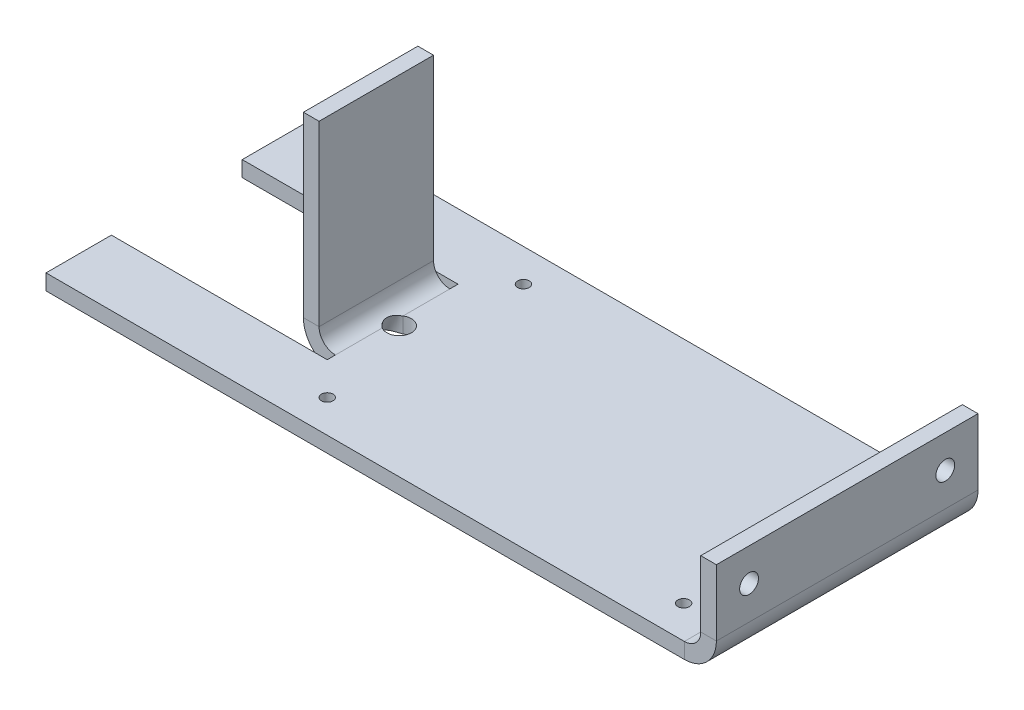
ISO-10303-21;
HEADER;
FILE_DESCRIPTION(('STEP AP214'),'2;1');
FILE_NAME('part.step','',(''),(''),'','','');
FILE_SCHEMA(('AUTOMOTIVE_DESIGN { 1 0 10303 214 1 1 1 1 }'));
ENDSEC;
DATA;
#1=APPLICATION_CONTEXT('core data for automotive mechanical design processes');
#2=APPLICATION_PROTOCOL_DEFINITION('international standard','automotive_design',2000,#1);
#3=PRODUCT_CONTEXT('',#1,'mechanical');
#4=PRODUCT('Part','Part','',(#3));
#5=PRODUCT_RELATED_PRODUCT_CATEGORY('part','',(#4));
#6=PRODUCT_DEFINITION_FORMATION('','',#4);
#7=PRODUCT_DEFINITION_CONTEXT('part definition',#1,'design');
#8=PRODUCT_DEFINITION('design','',#6,#7);
#9=PRODUCT_DEFINITION_SHAPE('','',#8);
#10=(LENGTH_UNIT() NAMED_UNIT(*) SI_UNIT(.MILLI.,.METRE.));
#11=(NAMED_UNIT(*) PLANE_ANGLE_UNIT() SI_UNIT($,.RADIAN.));
#12=(NAMED_UNIT(*) SI_UNIT($,.STERADIAN.) SOLID_ANGLE_UNIT());
#13=UNCERTAINTY_MEASURE_WITH_UNIT(LENGTH_MEASURE(1.E-05),#10,'distance_accuracy_value','');
#14=(GEOMETRIC_REPRESENTATION_CONTEXT(3) GLOBAL_UNCERTAINTY_ASSIGNED_CONTEXT((#13)) GLOBAL_UNIT_ASSIGNED_CONTEXT((#10,
#11,#12)) REPRESENTATION_CONTEXT('',''));
#15=CARTESIAN_POINT('',(0.,0.,0.));
#16=DIRECTION('',(0.,0.,1.));
#17=DIRECTION('',(1.,0.,0.));
#18=AXIS2_PLACEMENT_3D('',#15,#16,#17);
#19=CARTESIAN_POINT('',(-130.175,3.03784,25.4));
#20=DIRECTION('',(0.,1.,0.));
#21=DIRECTION('',(0.,0.,1.));
#22=AXIS2_PLACEMENT_3D('',#19,#20,#21);
#23=PLANE('',#22);
#24=CARTESIAN_POINT('',(-81.915,3.03784,-19.05));
#25=DIRECTION('',(0.,1.,0.));
#26=DIRECTION('',(0.,0.,1.));
#27=AXIS2_PLACEMENT_3D('',#24,#25,#26);
#28=CIRCLE('',#27,1.1303);
#29=CARTESIAN_POINT('',(-81.915,3.03784,-17.9197));
#30=VERTEX_POINT('',#29);
#31=EDGE_CURVE('E849',#30,#30,#28,.T.);
#32=ORIENTED_EDGE('',*,*,#31,.F.);
#33=EDGE_LOOP('',(#32));
#34=FACE_BOUND('',#33,.T.);
#35=CARTESIAN_POINT('',(-12.7,3.03784,-19.05));
#36=DIRECTION('',(0.,1.,0.));
#37=DIRECTION('',(0.,0.,1.));
#38=AXIS2_PLACEMENT_3D('',#35,#36,#37);
#39=CIRCLE('',#38,1.1303);
#40=CARTESIAN_POINT('',(-12.7,3.03784,-17.9197));
#41=VERTEX_POINT('',#40);
#42=EDGE_CURVE('E855',#41,#41,#39,.T.);
#43=ORIENTED_EDGE('',*,*,#42,.F.);
#44=EDGE_LOOP('',(#43));
#45=FACE_BOUND('',#44,.T.);
#46=CARTESIAN_POINT('',(-12.7,3.03784,19.05));
#47=DIRECTION('',(0.,1.,0.));
#48=DIRECTION('',(0.,0.,1.));
#49=AXIS2_PLACEMENT_3D('',#46,#47,#48);
#50=CIRCLE('',#49,1.1303);
#51=CARTESIAN_POINT('',(-12.7,3.03784,20.1803));
#52=VERTEX_POINT('',#51);
#53=EDGE_CURVE('E863',#52,#52,#50,.T.);
#54=ORIENTED_EDGE('',*,*,#53,.F.);
#55=EDGE_LOOP('',(#54));
#56=FACE_BOUND('',#55,.T.);
#57=CARTESIAN_POINT('',(-81.915,3.03784,19.05));
#58=DIRECTION('',(0.,1.,0.));
#59=DIRECTION('',(0.,0.,1.));
#60=AXIS2_PLACEMENT_3D('',#57,#58,#59);
#61=CIRCLE('',#60,1.1303);
#62=CARTESIAN_POINT('',(-81.915,3.03784,20.1803));
#63=VERTEX_POINT('',#62);
#64=EDGE_CURVE('E869',#63,#63,#61,.T.);
#65=ORIENTED_EDGE('',*,*,#64,.F.);
#66=EDGE_LOOP('',(#65));
#67=FACE_BOUND('',#66,.T.);
#68=DIRECTION('',(0.,0.,1.));
#69=VECTOR('',#68,1.);
#70=CARTESIAN_POINT('',(-88.265,3.03784000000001,11.1125));
#71=LINE('',#70,#69);
#72=CARTESIAN_POINT('',(-88.265,3.03784000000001,-2.01431168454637));
#73=VERTEX_POINT('',#72);
#74=CARTESIAN_POINT('',(-88.265,3.03784000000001,-11.1125));
#75=VERTEX_POINT('',#74);
#76=EDGE_CURVE('E808',#73,#75,#71,.F.);
#77=ORIENTED_EDGE('',*,*,#76,.F.);
#78=CARTESIAN_POINT('',(-86.995,3.03784,0.));
#79=DIRECTION('',(0.,1.,0.));
#80=DIRECTION('',(0.,0.,1.));
#81=AXIS2_PLACEMENT_3D('',#78,#79,#80);
#82=CIRCLE('',#81,2.38125000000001);
#83=CARTESIAN_POINT('',(-88.265,3.03784000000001,2.01431168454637));
#84=VERTEX_POINT('',#83);
#85=EDGE_CURVE('E81',#84,#73,#82,.T.);
#86=ORIENTED_EDGE('',*,*,#85,.F.);
#87=CARTESIAN_POINT('',(-88.265,3.03784000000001,11.1125));
#88=VERTEX_POINT('',#87);
#89=EDGE_CURVE('E227',#88,#84,#71,.F.);
#90=ORIENTED_EDGE('',*,*,#89,.F.);
#91=DIRECTION('',(0.,0.,-1.));
#92=VECTOR('',#91,1.);
#93=CARTESIAN_POINT('',(-88.265,3.03784,-12.7));
#94=LINE('',#93,#92);
#95=CARTESIAN_POINT('',(-88.265,3.03784,12.7));
#96=VERTEX_POINT('',#95);
#97=EDGE_CURVE('E263',#96,#88,#94,.T.);
#98=ORIENTED_EDGE('',*,*,#97,.F.);
#99=DIRECTION('',(1.,0.,0.));
#100=VECTOR('',#99,1.);
#101=CARTESIAN_POINT('',(-130.175,3.03784,12.7));
#102=LINE('',#101,#100);
#103=CARTESIAN_POINT('',(-130.175,3.03784,12.7));
#104=VERTEX_POINT('',#103);
#105=EDGE_CURVE('E264',#104,#96,#102,.T.);
#106=ORIENTED_EDGE('',*,*,#105,.F.);
#107=DIRECTION('',(0.,0.,-1.));
#108=VECTOR('',#107,1.);
#109=CARTESIAN_POINT('',(-130.175,3.03784,25.4));
#110=LINE('',#109,#108);
#111=CARTESIAN_POINT('',(-130.175,3.03784,25.4));
#112=VERTEX_POINT('',#111);
#113=EDGE_CURVE('E337',#112,#104,#110,.T.);
#114=ORIENTED_EDGE('',*,*,#113,.F.);
#115=DIRECTION('',(1.,0.,0.));
#116=VECTOR('',#115,1.);
#117=CARTESIAN_POINT('',(-130.175,3.03784,25.4));
#118=LINE('',#117,#116);
#119=CARTESIAN_POINT('',(-6.21284,3.03784,25.4));
#120=VERTEX_POINT('',#119);
#121=EDGE_CURVE('E292',#112,#120,#118,.T.);
#122=ORIENTED_EDGE('',*,*,#121,.T.);
#123=DIRECTION('',(0.,0.,-1.));
#124=VECTOR('',#123,1.);
#125=CARTESIAN_POINT('',(-6.21284,3.03784,25.4));
#126=LINE('',#125,#124);
#127=CARTESIAN_POINT('',(-6.21284,3.03784,-25.4));
#128=VERTEX_POINT('',#127);
#129=EDGE_CURVE('E340',#120,#128,#126,.T.);
#130=ORIENTED_EDGE('',*,*,#129,.T.);
#131=DIRECTION('',(1.,0.,0.));
#132=VECTOR('',#131,1.);
#133=CARTESIAN_POINT('',(-130.175,3.03784,-25.4));
#134=LINE('',#133,#132);
#135=CARTESIAN_POINT('',(-130.175,3.03784,-25.4));
#136=VERTEX_POINT('',#135);
#137=EDGE_CURVE('E316',#136,#128,#134,.T.);
#138=ORIENTED_EDGE('',*,*,#137,.F.);
#139=CARTESIAN_POINT('',(-130.175,3.03784,-12.7));
#140=VERTEX_POINT('',#139);
#141=EDGE_CURVE('E336',#140,#136,#110,.T.);
#142=ORIENTED_EDGE('',*,*,#141,.F.);
#143=DIRECTION('',(-1.,0.,0.));
#144=VECTOR('',#143,1.);
#145=CARTESIAN_POINT('',(-130.175,3.03784,-12.7));
#146=LINE('',#145,#144);
#147=CARTESIAN_POINT('',(-88.265,3.03784,-12.7));
#148=VERTEX_POINT('',#147);
#149=EDGE_CURVE('E252',#148,#140,#146,.T.);
#150=ORIENTED_EDGE('',*,*,#149,.F.);
#151=EDGE_CURVE('E260',#75,#148,#94,.T.);
#152=ORIENTED_EDGE('',*,*,#151,.F.);
#153=EDGE_LOOP('',(#77,#86,#90,#98,#106,#114,#122,#130,#138,#142,#150,#152));
#154=FACE_BOUND('',#153,.T.);
#155=ADVANCED_FACE('F56',(#34,#45,#56,#67,#154),#23,.T.);
#156=CARTESIAN_POINT('',(-130.175,0.,25.4));
#157=DIRECTION('',(0.,1.,0.));
#158=DIRECTION('',(0.,0.,1.));
#159=AXIS2_PLACEMENT_3D('',#156,#157,#158);
#160=PLANE('',#159);
#161=CARTESIAN_POINT('',(-81.915,0.,-19.05));
#162=DIRECTION('',(0.,1.,0.));
#163=DIRECTION('',(0.,0.,1.));
#164=AXIS2_PLACEMENT_3D('',#161,#162,#163);
#165=CIRCLE('',#164,1.1303);
#166=CARTESIAN_POINT('',(-81.915,0.,-17.9197));
#167=VERTEX_POINT('',#166);
#168=EDGE_CURVE('E824',#167,#167,#165,.T.);
#169=ORIENTED_EDGE('',*,*,#168,.T.);
#170=EDGE_LOOP('',(#169));
#171=FACE_BOUND('',#170,.T.);
#172=CARTESIAN_POINT('',(-12.7,0.,-19.05));
#173=DIRECTION('',(0.,1.,0.));
#174=DIRECTION('',(0.,0.,1.));
#175=AXIS2_PLACEMENT_3D('',#172,#173,#174);
#176=CIRCLE('',#175,1.1303);
#177=CARTESIAN_POINT('',(-12.7,0.,-17.9197));
#178=VERTEX_POINT('',#177);
#179=EDGE_CURVE('E852',#178,#178,#176,.T.);
#180=ORIENTED_EDGE('',*,*,#179,.T.);
#181=EDGE_LOOP('',(#180));
#182=FACE_BOUND('',#181,.T.);
#183=CARTESIAN_POINT('',(-12.7,0.,19.05));
#184=DIRECTION('',(0.,1.,0.));
#185=DIRECTION('',(0.,0.,1.));
#186=AXIS2_PLACEMENT_3D('',#183,#184,#185);
#187=CIRCLE('',#186,1.1303);
#188=CARTESIAN_POINT('',(-12.7,0.,20.1803));
#189=VERTEX_POINT('',#188);
#190=EDGE_CURVE('E860',#189,#189,#187,.T.);
#191=ORIENTED_EDGE('',*,*,#190,.T.);
#192=EDGE_LOOP('',(#191));
#193=FACE_BOUND('',#192,.T.);
#194=CARTESIAN_POINT('',(-81.915,0.,19.05));
#195=DIRECTION('',(0.,1.,0.));
#196=DIRECTION('',(0.,0.,1.));
#197=AXIS2_PLACEMENT_3D('',#194,#195,#196);
#198=CIRCLE('',#197,1.1303);
#199=CARTESIAN_POINT('',(-81.915,0.,20.1803));
#200=VERTEX_POINT('',#199);
#201=EDGE_CURVE('E866',#200,#200,#198,.T.);
#202=ORIENTED_EDGE('',*,*,#201,.T.);
#203=EDGE_LOOP('',(#202));
#204=FACE_BOUND('',#203,.T.);
#205=CARTESIAN_POINT('',(-86.995,0.,0.));
#206=DIRECTION('',(0.,1.,0.));
#207=DIRECTION('',(0.,0.,1.));
#208=AXIS2_PLACEMENT_3D('',#205,#206,#207);
#209=CIRCLE('',#208,2.38125000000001);
#210=CARTESIAN_POINT('',(-88.265,0.,2.01431168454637));
#211=VERTEX_POINT('',#210);
#212=CARTESIAN_POINT('',(-88.265,0.,-2.01431168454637));
#213=VERTEX_POINT('',#212);
#214=EDGE_CURVE('E206',#211,#213,#209,.T.);
#215=ORIENTED_EDGE('',*,*,#214,.T.);
#216=DIRECTION('',(0.,0.,1.));
#217=VECTOR('',#216,1.);
#218=CARTESIAN_POINT('',(-88.265,0.,11.1125));
#219=LINE('',#218,#217);
#220=CARTESIAN_POINT('',(-88.265,0.,-11.1125));
#221=VERTEX_POINT('',#220);
#222=EDGE_CURVE('E60',#213,#221,#219,.F.);
#223=ORIENTED_EDGE('',*,*,#222,.T.);
#224=DIRECTION('',(0.,0.,-1.));
#225=VECTOR('',#224,1.);
#226=CARTESIAN_POINT('',(-88.265,0.,-12.7));
#227=LINE('',#226,#225);
#228=CARTESIAN_POINT('',(-88.265,0.,-12.7));
#229=VERTEX_POINT('',#228);
#230=EDGE_CURVE('E231',#221,#229,#227,.T.);
#231=ORIENTED_EDGE('',*,*,#230,.T.);
#232=DIRECTION('',(-1.,0.,0.));
#233=VECTOR('',#232,1.);
#234=CARTESIAN_POINT('',(-130.175,0.,-12.7));
#235=LINE('',#234,#233);
#236=CARTESIAN_POINT('',(-130.175,0.,-12.7));
#237=VERTEX_POINT('',#236);
#238=EDGE_CURVE('E255',#229,#237,#235,.T.);
#239=ORIENTED_EDGE('',*,*,#238,.T.);
#240=DIRECTION('',(0.,0.,-1.));
#241=VECTOR('',#240,1.);
#242=CARTESIAN_POINT('',(-130.175,0.,25.4));
#243=LINE('',#242,#241);
#244=CARTESIAN_POINT('',(-130.175,0.,-25.4));
#245=VERTEX_POINT('',#244);
#246=EDGE_CURVE('E332',#237,#245,#243,.T.);
#247=ORIENTED_EDGE('',*,*,#246,.T.);
#248=DIRECTION('',(1.,0.,0.));
#249=VECTOR('',#248,1.);
#250=CARTESIAN_POINT('',(-130.175,0.,-25.4));
#251=LINE('',#250,#249);
#252=CARTESIAN_POINT('',(-6.21284,0.,-25.4));
#253=VERTEX_POINT('',#252);
#254=EDGE_CURVE('E322',#245,#253,#251,.T.);
#255=ORIENTED_EDGE('',*,*,#254,.T.);
#256=DIRECTION('',(0.,0.,-1.));
#257=VECTOR('',#256,1.);
#258=CARTESIAN_POINT('',(-6.21284,0.,25.4));
#259=LINE('',#258,#257);
#260=CARTESIAN_POINT('',(-6.21284,0.,25.4));
#261=VERTEX_POINT('',#260);
#262=EDGE_CURVE('E329',#261,#253,#259,.T.);
#263=ORIENTED_EDGE('',*,*,#262,.F.);
#264=DIRECTION('',(1.,0.,0.));
#265=VECTOR('',#264,1.);
#266=CARTESIAN_POINT('',(-130.175,0.,25.4));
#267=LINE('',#266,#265);
#268=CARTESIAN_POINT('',(-130.175,0.,25.4));
#269=VERTEX_POINT('',#268);
#270=EDGE_CURVE('E298',#269,#261,#267,.T.);
#271=ORIENTED_EDGE('',*,*,#270,.F.);
#272=CARTESIAN_POINT('',(-130.175,0.,12.7));
#273=VERTEX_POINT('',#272);
#274=EDGE_CURVE('E333',#269,#273,#243,.T.);
#275=ORIENTED_EDGE('',*,*,#274,.T.);
#276=DIRECTION('',(1.,0.,0.));
#277=VECTOR('',#276,1.);
#278=CARTESIAN_POINT('',(-130.175,0.,12.7));
#279=LINE('',#278,#277);
#280=CARTESIAN_POINT('',(-88.265,0.,12.7));
#281=VERTEX_POINT('',#280);
#282=EDGE_CURVE('E250',#273,#281,#279,.T.);
#283=ORIENTED_EDGE('',*,*,#282,.T.);
#284=CARTESIAN_POINT('',(-88.265,0.,11.1125));
#285=VERTEX_POINT('',#284);
#286=EDGE_CURVE('E258',#281,#285,#227,.T.);
#287=ORIENTED_EDGE('',*,*,#286,.T.);
#288=EDGE_CURVE('E213',#285,#211,#219,.F.);
#289=ORIENTED_EDGE('',*,*,#288,.T.);
#290=EDGE_LOOP('',(#215,#223,#231,#239,#247,#255,#263,#271,#275,#283,#287,#289));
#291=FACE_BOUND('',#290,.T.);
#292=ADVANCED_FACE('F210',(#171,#182,#193,#204,#291),#160,.F.);
#293=CARTESIAN_POINT('',(-88.265,6.21283999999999,11.1125));
#294=DIRECTION('',(0.,0.,1.));
#295=DIRECTION('',(-1.,0.,0.));
#296=AXIS2_PLACEMENT_3D('',#293,#294,#295);
#297=CYLINDRICAL_SURFACE('',#296,6.21283999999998);
#298=ORIENTED_EDGE('',*,*,#222,.F.);
#299=CARTESIAN_POINT('',(-88.265,0.,2.01431168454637));
#300=CARTESIAN_POINT('',(-88.3386574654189,-5.28302749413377E-06,1.99057717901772));
#301=CARTESIAN_POINT('',(-88.4118997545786,0.00130970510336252,1.96552970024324));
#302=CARTESIAN_POINT('',(-88.5574210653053,0.00645901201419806,1.91256546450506));
#303=CARTESIAN_POINT('',(-88.6296977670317,0.0102985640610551,1.88464284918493));
#304=CARTESIAN_POINT('',(-88.7729027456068,0.0203787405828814,1.82575891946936));
#305=CARTESIAN_POINT('',(-88.8438299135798,0.026621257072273,1.79479522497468));
#306=CARTESIAN_POINT('',(-88.9846400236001,0.0414093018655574,1.72935258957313));
#307=CARTESIAN_POINT('',(-89.0545063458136,0.0499764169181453,1.69484268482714));
#308=CARTESIAN_POINT('',(-89.1920812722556,0.0691666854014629,1.62237468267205));
#309=CARTESIAN_POINT('',(-89.2597912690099,0.0797884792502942,1.58441887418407));
#310=CARTESIAN_POINT('',(-89.3926256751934,0.102817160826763,1.50477248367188));
#311=CARTESIAN_POINT('',(-89.4577515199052,0.115223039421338,1.46308401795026));
#312=CARTESIAN_POINT('',(-89.5685100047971,0.138091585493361,1.3868477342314));
#313=CARTESIAN_POINT('',(-89.614845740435,0.148232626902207,1.35322352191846));
#314=CARTESIAN_POINT('',(-89.7055150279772,0.169127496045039,1.28353068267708));
#315=CARTESIAN_POINT('',(-89.7498483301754,0.179881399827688,1.24746175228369));
#316=CARTESIAN_POINT('',(-89.8360820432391,0.201762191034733,1.17277132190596));
#317=CARTESIAN_POINT('',(-89.8779865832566,0.212888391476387,1.13415440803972));
#318=CARTESIAN_POINT('',(-89.9589620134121,0.2352453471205,1.0540809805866));
#319=CARTESIAN_POINT('',(-89.9980334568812,0.246476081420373,1.0126250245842));
#320=CARTESIAN_POINT('',(-90.0658425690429,0.266635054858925,0.934807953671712));
#321=CARTESIAN_POINT('',(-90.0951444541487,0.275600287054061,0.898948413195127));
#322=CARTESIAN_POINT('',(-90.1512099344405,0.293173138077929,0.825199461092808));
#323=CARTESIAN_POINT('',(-90.1779733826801,0.301780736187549,0.787309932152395));
#324=CARTESIAN_POINT('',(-90.2284461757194,0.3183541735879,0.709546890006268));
#325=CARTESIAN_POINT('',(-90.2521635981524,0.32632168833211,0.66967902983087));
#326=CARTESIAN_POINT('',(-90.2960386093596,0.341315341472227,0.587880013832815));
#327=CARTESIAN_POINT('',(-90.3161976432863,0.348341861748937,0.545949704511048));
#328=CARTESIAN_POINT('',(-90.3608676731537,0.364121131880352,0.440314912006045));
#329=CARTESIAN_POINT('',(-90.3830868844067,0.372171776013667,0.375500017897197));
#330=CARTESIAN_POINT('',(-90.4170660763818,0.384604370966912,0.242857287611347));
#331=CARTESIAN_POINT('',(-90.4288369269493,0.388990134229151,0.175032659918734));
#332=CARTESIAN_POINT('',(-90.4408498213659,0.393466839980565,0.0378899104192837));
#333=CARTESIAN_POINT('',(-90.4410394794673,0.393538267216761,-0.0314335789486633));
#334=CARTESIAN_POINT('',(-90.4297599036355,0.389333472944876,-0.168996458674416));
#335=CARTESIAN_POINT('',(-90.4182860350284,0.385055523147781,-0.237235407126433));
#336=CARTESIAN_POINT('',(-90.3856456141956,0.373104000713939,-0.366912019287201));
#337=CARTESIAN_POINT('',(-90.3650512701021,0.365631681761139,-0.428517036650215));
#338=CARTESIAN_POINT('',(-90.3159736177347,0.348237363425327,-0.548100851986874));
#339=CARTESIAN_POINT('',(-90.2874869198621,0.338314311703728,-0.606078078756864));
#340=CARTESIAN_POINT('',(-90.2286498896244,0.318412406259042,-0.709878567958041));
#341=CARTESIAN_POINT('',(-90.1991684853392,0.308650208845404,-0.756245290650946));
#342=CARTESIAN_POINT('',(-90.1363007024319,0.28842346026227,-0.846103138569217));
#343=CARTESIAN_POINT('',(-90.1029117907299,0.277958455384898,-0.889592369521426));
#344=CARTESIAN_POINT('',(-89.9977139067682,0.246063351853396,-1.01610573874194));
#345=CARTESIAN_POINT('',(-89.9209989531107,0.22417712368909,-1.09496638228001));
#346=CARTESIAN_POINT('',(-89.7722311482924,0.185193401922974,-1.22986673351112));
#347=CARTESIAN_POINT('',(-89.7016244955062,0.167917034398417,-1.28750281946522));
#348=CARTESIAN_POINT('',(-89.5555123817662,0.135046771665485,-1.39683643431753));
#349=CARTESIAN_POINT('',(-89.4800032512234,0.119454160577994,-1.44852943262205));
#350=CARTESIAN_POINT('',(-89.3250310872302,0.0905906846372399,-1.54652047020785));
#351=CARTESIAN_POINT('',(-89.2455633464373,0.0773226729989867,-1.59281185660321));
#352=CARTESIAN_POINT('',(-89.0835624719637,0.0536157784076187,-1.68038276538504));
#353=CARTESIAN_POINT('',(-89.0010305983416,0.0431757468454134,-1.72166431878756));
#354=CARTESIAN_POINT('',(-88.8114667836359,0.0231675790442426,-1.80992212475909));
#355=CARTESIAN_POINT('',(-88.7037013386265,0.0145513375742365,-1.85553952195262));
#356=CARTESIAN_POINT('',(-88.485918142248,0.00296905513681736,-1.93985013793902));
#357=CARTESIAN_POINT('',(-88.375917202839,-2.9662400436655E-05,-1.97858220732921));
#358=CARTESIAN_POINT('',(-88.265,0.,-2.01431168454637));
#359=B_SPLINE_CURVE_WITH_KNOTS('',3,(#299,#300,#301,#302,#303,#304,#305,#306,#307,#308,#309,
#310,#311,#312,#313,#314,#315,#316,#317,#318,#319,#320,#321,#322,#323,#324,#325,#326,#327,#328,
#329,#330,#331,#332,#333,#334,#335,#336,#337,#338,#339,#340,#341,#342,#343,#344,#345,#346,#347,
#348,#349,#350,#351,#352,#353,#354,#355,#356,#357,#358),.UNSPECIFIED.,.F.,.F.,(4,2,2,2,2,2,2,2,
2,2,2,2,2,2,2,2,2,2,2,2,2,2,2,2,2,2,2,2,2,4),(0.,0.232148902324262,0.464780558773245,
0.697595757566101,0.932651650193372,1.16755253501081,1.40232107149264,1.57666757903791,
1.75103576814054,1.92509824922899,2.09912664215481,2.24053435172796,2.38195024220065,
2.52298301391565,2.66395837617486,2.87006007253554,3.07594710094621,3.28276535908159,
3.48966583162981,3.68510367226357,3.88062557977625,4.0478012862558,4.21508597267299,
4.55038992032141,4.82835384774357,5.10652828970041,5.38504180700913,5.66344203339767,
6.01508163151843,6.36466934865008),.UNSPECIFIED.);
#360=EDGE_CURVE('E194',#211,#213,#359,.T.);
#361=ORIENTED_EDGE('',*,*,#360,.F.);
#362=ORIENTED_EDGE('',*,*,#288,.F.);
#363=CARTESIAN_POINT('',(-88.265,6.21283999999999,11.1125));
#364=DIRECTION('',(0.,0.,1.));
#365=DIRECTION('',(1.,0.,0.));
#366=AXIS2_PLACEMENT_3D('',#363,#364,#365);
#367=CIRCLE('',#366,6.21283999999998);
#368=CARTESIAN_POINT('',(-94.47784,6.21283999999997,11.1125));
#369=VERTEX_POINT('',#368);
#370=EDGE_CURVE('E220',#369,#285,#367,.T.);
#371=ORIENTED_EDGE('',*,*,#370,.F.);
#372=DIRECTION('',(0.,0.,1.));
#373=VECTOR('',#372,1.);
#374=CARTESIAN_POINT('',(-94.47784,6.21283999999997,-11.1125));
#375=LINE('',#374,#373);
#376=CARTESIAN_POINT('',(-94.47784,6.21283999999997,-11.1125));
#377=VERTEX_POINT('',#376);
#378=EDGE_CURVE('E840',#369,#377,#375,.F.);
#379=ORIENTED_EDGE('',*,*,#378,.T.);
#380=CARTESIAN_POINT('',(-88.265,6.21283999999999,-11.1125));
#381=DIRECTION('',(0.,0.,1.));
#382=DIRECTION('',(1.,0.,0.));
#383=AXIS2_PLACEMENT_3D('',#380,#381,#382);
#384=CIRCLE('',#383,6.21283999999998);
#385=EDGE_CURVE('E218',#221,#377,#384,.F.);
#386=ORIENTED_EDGE('',*,*,#385,.F.);
#387=EDGE_LOOP('',(#298,#361,#362,#371,#379,#386));
#388=FACE_BOUND('',#387,.T.);
#389=ADVANCED_FACE('F216',(#388),#297,.T.);
#390=CARTESIAN_POINT('',(-88.265,6.21283999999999,11.1125));
#391=DIRECTION('',(0.,0.,1.));
#392=DIRECTION('',(-1.,0.,0.));
#393=AXIS2_PLACEMENT_3D('',#390,#391,#392);
#394=CYLINDRICAL_SURFACE('',#393,3.17499999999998);
#395=CARTESIAN_POINT('',(-88.265,3.03784000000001,2.01431168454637));
#396=CARTESIAN_POINT('',(-88.3200561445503,3.03783610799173,1.97964064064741));
#397=CARTESIAN_POINT('',(-88.3736414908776,3.03927208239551,1.9427221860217));
#398=CARTESIAN_POINT('',(-88.4774901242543,3.04453323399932,1.86470895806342));
#399=CARTESIAN_POINT('',(-88.5277561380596,3.04835642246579,1.8236176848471));
#400=CARTESIAN_POINT('',(-88.6727903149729,3.06264203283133,1.69477935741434));
#401=CARTESIAN_POINT('',(-88.7621957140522,3.07592755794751,1.60121394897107));
#402=CARTESIAN_POINT('',(-88.9243778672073,3.10596853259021,1.40152290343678));
#403=CARTESIAN_POINT('',(-88.9971890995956,3.12271664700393,1.2954240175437));
#404=CARTESIAN_POINT('',(-89.0928379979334,3.14748615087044,1.12849709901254));
#405=CARTESIAN_POINT('',(-89.1224793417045,3.15569080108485,1.07150581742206));
#406=CARTESIAN_POINT('',(-89.1770854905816,3.1715352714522,0.955255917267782));
#407=CARTESIAN_POINT('',(-89.2020515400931,3.17917524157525,0.895997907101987));
#408=CARTESIAN_POINT('',(-89.2483636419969,3.19386014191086,0.772528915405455));
#409=CARTESIAN_POINT('',(-89.2694624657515,3.20085537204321,0.70821905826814));
#410=CARTESIAN_POINT('',(-89.306073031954,3.21331196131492,0.577880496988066));
#411=CARTESIAN_POINT('',(-89.3215849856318,3.21877337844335,0.51185185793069));
#412=CARTESIAN_POINT('',(-89.3469393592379,3.22784201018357,0.378633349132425));
#413=CARTESIAN_POINT('',(-89.3567855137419,3.23145044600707,0.311444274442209));
#414=CARTESIAN_POINT('',(-89.3706878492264,3.23657810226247,0.176389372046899));
#415=CARTESIAN_POINT('',(-89.3747440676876,3.23809733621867,0.10852354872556));
#416=CARTESIAN_POINT('',(-89.3770030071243,3.23894081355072,-0.0236757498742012));
#417=CARTESIAN_POINT('',(-89.3755083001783,3.23837852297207,-0.0880032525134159));
#418=CARTESIAN_POINT('',(-89.3673259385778,3.23533838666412,-0.216286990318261));
#419=CARTESIAN_POINT('',(-89.3606361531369,3.23285975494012,-0.28024306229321));
#420=CARTESIAN_POINT('',(-89.3328119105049,3.22271697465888,-0.470826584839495));
#421=CARTESIAN_POINT('',(-89.3039247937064,3.21234642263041,-0.59630371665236));
#422=CARTESIAN_POINT('',(-89.2462225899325,3.19320280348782,-0.778559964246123));
#423=CARTESIAN_POINT('',(-89.2247461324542,3.18627021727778,-0.83801568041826));
#424=CARTESIAN_POINT('',(-89.1772144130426,3.17160427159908,-0.954987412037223));
#425=CARTESIAN_POINT('',(-89.1511593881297,3.16387095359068,-1.01250352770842));
#426=CARTESIAN_POINT('',(-89.0945354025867,3.14798116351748,-1.12528702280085));
#427=CARTESIAN_POINT('',(-89.0639612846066,3.13982421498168,-1.18055173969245));
#428=CARTESIAN_POINT('',(-88.9984785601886,3.12354062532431,-1.2884563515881));
#429=CARTESIAN_POINT('',(-88.963569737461,3.11541398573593,-1.34109611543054));
#430=CARTESIAN_POINT('',(-88.8872801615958,3.09915805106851,-1.44691938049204));
#431=CARTESIAN_POINT('',(-88.8456246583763,3.09106378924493,-1.49991061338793));
#432=CARTESIAN_POINT('',(-88.7578565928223,3.07601109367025,-1.60223669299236));
#433=CARTESIAN_POINT('',(-88.7117444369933,3.06905255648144,-1.65157187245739));
#434=CARTESIAN_POINT('',(-88.6155275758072,3.05687686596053,-1.74613608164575));
#435=CARTESIAN_POINT('',(-88.5654343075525,3.05165493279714,-1.79137612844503));
#436=CARTESIAN_POINT('',(-88.4614586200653,3.04349606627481,-1.87744549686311));
#437=CARTESIAN_POINT('',(-88.4075794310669,3.04055721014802,-1.91827850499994));
#438=CARTESIAN_POINT('',(-88.3377589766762,3.03864143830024,-1.96665986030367));
#439=CARTESIAN_POINT('',(-88.3233482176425,3.03834294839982,-1.97641351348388));
#440=CARTESIAN_POINT('',(-88.294325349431,3.03794232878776,-1.99560089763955));
#441=CARTESIAN_POINT('',(-88.2797133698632,3.03784007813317,-2.00503482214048));
#442=CARTESIAN_POINT('',(-88.265,3.03784000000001,-2.01431168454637));
#443=B_SPLINE_CURVE_WITH_KNOTS('',3,(#395,#396,#397,#398,#399,#400,#401,#402,#403,#404,#405,
#406,#407,#408,#409,#410,#411,#412,#413,#414,#415,#416,#417,#418,#419,#420,#421,#422,#423,#424,
#425,#426,#427,#428,#429,#430,#431,#432,#433,#434,#435,#436,#437,#438,#439,#440,#441,#442),
.UNSPECIFIED.,.F.,.F.,(4,2,2,2,2,2,2,2,2,2,2,2,2,2,2,2,2,2,2,2,2,2,2,4),(0.,0.195038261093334,
0.389914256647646,0.778262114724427,1.16579557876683,1.35989757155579,1.55394782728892,
1.75782127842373,1.96168702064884,2.16541823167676,2.36914812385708,2.56194012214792,
2.75481123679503,3.14015540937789,3.33079398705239,3.52142269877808,3.71227066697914,
3.90312816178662,4.10654811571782,4.30994953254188,4.51278638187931,4.71545221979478,
4.76766044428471,4.81983648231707),.UNSPECIFIED.);
#444=EDGE_CURVE('E202',#84,#73,#443,.T.);
#445=ORIENTED_EDGE('',*,*,#444,.T.);
#446=ORIENTED_EDGE('',*,*,#76,.T.);
#447=CARTESIAN_POINT('',(-88.265,6.21283999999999,-11.1125));
#448=DIRECTION('',(0.,0.,1.));
#449=DIRECTION('',(1.,0.,0.));
#450=AXIS2_PLACEMENT_3D('',#447,#448,#449);
#451=CIRCLE('',#450,3.17499999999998);
#452=CARTESIAN_POINT('',(-91.44,6.21283999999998,-11.1125));
#453=VERTEX_POINT('',#452);
#454=EDGE_CURVE('E222',#75,#453,#451,.F.);
#455=ORIENTED_EDGE('',*,*,#454,.T.);
#456=DIRECTION('',(0.,0.,1.));
#457=VECTOR('',#456,1.);
#458=CARTESIAN_POINT('',(-91.44,6.21283999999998,-11.1125));
#459=LINE('',#458,#457);
#460=CARTESIAN_POINT('',(-91.44,6.21283999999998,11.1125));
#461=VERTEX_POINT('',#460);
#462=EDGE_CURVE('E844',#453,#461,#459,.T.);
#463=ORIENTED_EDGE('',*,*,#462,.T.);
#464=CARTESIAN_POINT('',(-88.265,6.21283999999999,11.1125));
#465=DIRECTION('',(0.,0.,1.));
#466=DIRECTION('',(1.,0.,0.));
#467=AXIS2_PLACEMENT_3D('',#464,#465,#466);
#468=CIRCLE('',#467,3.17499999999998);
#469=EDGE_CURVE('E243',#461,#88,#468,.T.);
#470=ORIENTED_EDGE('',*,*,#469,.T.);
#471=ORIENTED_EDGE('',*,*,#89,.T.);
#472=EDGE_LOOP('',(#445,#446,#455,#463,#470,#471));
#473=FACE_BOUND('',#472,.T.);
#474=ADVANCED_FACE('F634',(#473),#394,.F.);
#475=CARTESIAN_POINT('',(-88.265,0.,-12.7));
#476=DIRECTION('',(1.,0.,0.));
#477=DIRECTION('',(0.,0.,-1.));
#478=AXIS2_PLACEMENT_3D('',#475,#476,#477);
#479=PLANE('',#478);
#480=DIRECTION('',(0.,-1.,0.));
#481=VECTOR('',#480,1.);
#482=CARTESIAN_POINT('',(-88.265,3.03784000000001,-11.1125));
#483=LINE('',#482,#481);
#484=EDGE_CURVE('E242',#75,#221,#483,.T.);
#485=ORIENTED_EDGE('',*,*,#484,.F.);
#486=ORIENTED_EDGE('',*,*,#151,.T.);
#487=DIRECTION('',(0.,1.,0.));
#488=VECTOR('',#487,1.);
#489=CARTESIAN_POINT('',(-88.265,0.,-12.7));
#490=LINE('',#489,#488);
#491=EDGE_CURVE('E273',#229,#148,#490,.T.);
#492=ORIENTED_EDGE('',*,*,#491,.F.);
#493=ORIENTED_EDGE('',*,*,#230,.F.);
#494=EDGE_LOOP('',(#485,#486,#492,#493));
#495=FACE_BOUND('',#494,.T.);
#496=ADVANCED_FACE('F485',(#495),#479,.F.);
#497=CARTESIAN_POINT('',(-130.175,0.,25.4));
#498=DIRECTION('',(-1.,0.,0.));
#499=DIRECTION('',(0.,0.,1.));
#500=AXIS2_PLACEMENT_3D('',#497,#498,#499);
#501=PLANE('',#500);
#502=DIRECTION('',(0.,1.,0.));
#503=VECTOR('',#502,1.);
#504=CARTESIAN_POINT('',(-130.175,0.,-12.7));
#505=LINE('',#504,#503);
#506=EDGE_CURVE('E269',#237,#140,#505,.T.);
#507=ORIENTED_EDGE('',*,*,#506,.T.);
#508=ORIENTED_EDGE('',*,*,#141,.T.);
#509=DIRECTION('',(0.,1.,0.));
#510=VECTOR('',#509,1.);
#511=CARTESIAN_POINT('',(-130.175,0.,-25.4));
#512=LINE('',#511,#510);
#513=EDGE_CURVE('E319',#245,#136,#512,.T.);
#514=ORIENTED_EDGE('',*,*,#513,.F.);
#515=ORIENTED_EDGE('',*,*,#246,.F.);
#516=EDGE_LOOP('',(#507,#508,#514,#515));
#517=FACE_BOUND('',#516,.T.);
#518=ADVANCED_FACE('F446',(#517),#501,.T.);
#519=CARTESIAN_POINT('',(-6.21284,0.,25.4));
#520=DIRECTION('',(0.,0.,1.));
#521=DIRECTION('',(1.,0.,0.));
#522=AXIS2_PLACEMENT_3D('',#519,#520,#521);
#523=PLANE('',#522);
#524=DIRECTION('',(0.,1.,0.));
#525=VECTOR('',#524,1.);
#526=CARTESIAN_POINT('',(-6.21284,0.,25.4));
#527=LINE('',#526,#525);
#528=EDGE_CURVE('E13',#261,#120,#527,.T.);
#529=ORIENTED_EDGE('',*,*,#528,.F.);
#530=CARTESIAN_POINT('',(-6.21284,6.21284,25.4));
#531=DIRECTION('',(0.,0.,-1.));
#532=DIRECTION('',(-1.,0.,0.));
#533=AXIS2_PLACEMENT_3D('',#530,#531,#532);
#534=CIRCLE('',#533,6.21284);
#535=CARTESIAN_POINT('',(0.,6.21284,25.4));
#536=VERTEX_POINT('',#535);
#537=EDGE_CURVE('E301',#261,#536,#534,.F.);
#538=ORIENTED_EDGE('',*,*,#537,.T.);
#539=DIRECTION('',(1.,0.,0.));
#540=VECTOR('',#539,1.);
#541=CARTESIAN_POINT('',(-3.03784,6.21283999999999,25.4));
#542=LINE('',#541,#540);
#543=CARTESIAN_POINT('',(-3.03784,6.21283999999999,25.4));
#544=VERTEX_POINT('',#543);
#545=EDGE_CURVE('E66',#544,#536,#542,.T.);
#546=ORIENTED_EDGE('',*,*,#545,.F.);
#547=CARTESIAN_POINT('',(-6.21284,6.21284,25.4));
#548=DIRECTION('',(0.,0.,1.));
#549=DIRECTION('',(1.,0.,0.));
#550=AXIS2_PLACEMENT_3D('',#547,#548,#549);
#551=CIRCLE('',#550,3.175);
#552=EDGE_CURVE('E289',#120,#544,#551,.T.);
#553=ORIENTED_EDGE('',*,*,#552,.F.);
#554=EDGE_LOOP('',(#529,#538,#546,#553));
#555=FACE_BOUND('',#554,.T.);
#556=ADVANCED_FACE('F58',(#555),#523,.T.);
#557=CARTESIAN_POINT('',(-3.03784,6.21283999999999,25.4));
#558=DIRECTION('',(0.,0.,1.));
#559=DIRECTION('',(1.,0.,0.));
#560=AXIS2_PLACEMENT_3D('',#557,#558,#559);
#561=PLANE('',#560);
#562=ORIENTED_EDGE('',*,*,#270,.T.);
#563=ORIENTED_EDGE('',*,*,#528,.T.);
#564=ORIENTED_EDGE('',*,*,#121,.F.);
#565=DIRECTION('',(0.,1.,0.));
#566=VECTOR('',#565,1.);
#567=CARTESIAN_POINT('',(-130.175,0.,25.4));
#568=LINE('',#567,#566);
#569=EDGE_CURVE('E295',#269,#112,#568,.T.);
#570=ORIENTED_EDGE('',*,*,#569,.F.);
#571=EDGE_LOOP('',(#562,#563,#564,#570));
#572=FACE_BOUND('',#571,.T.);
#573=ADVANCED_FACE('F388',(#572),#561,.T.);
#574=CARTESIAN_POINT('',(0.,6.21284,-25.4));
#575=DIRECTION('',(0.,0.,-1.));
#576=DIRECTION('',(-1.,0.,0.));
#577=AXIS2_PLACEMENT_3D('',#574,#575,#576);
#578=PLANE('',#577);
#579=DIRECTION('',(-1.,0.,0.));
#580=VECTOR('',#579,1.);
#581=CARTESIAN_POINT('',(0.,6.21284,-25.4));
#582=LINE('',#581,#580);
#583=CARTESIAN_POINT('',(0.,6.21284,-25.4));
#584=VERTEX_POINT('',#583);
#585=CARTESIAN_POINT('',(-3.03784,6.21283999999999,-25.4));
#586=VERTEX_POINT('',#585);
#587=EDGE_CURVE('E352',#584,#586,#582,.T.);
#588=ORIENTED_EDGE('',*,*,#587,.F.);
#589=CARTESIAN_POINT('',(-6.21284,6.21284,-25.4));
#590=DIRECTION('',(0.,0.,-1.));
#591=DIRECTION('',(-1.,0.,0.));
#592=AXIS2_PLACEMENT_3D('',#589,#590,#591);
#593=CIRCLE('',#592,6.21284);
#594=EDGE_CURVE('E283',#253,#584,#593,.F.);
#595=ORIENTED_EDGE('',*,*,#594,.F.);
#596=DIRECTION('',(0.,-1.,0.));
#597=VECTOR('',#596,1.);
#598=CARTESIAN_POINT('',(-6.21284,3.03784,-25.4));
#599=LINE('',#598,#597);
#600=EDGE_CURVE('E350',#128,#253,#599,.T.);
#601=ORIENTED_EDGE('',*,*,#600,.F.);
#602=CARTESIAN_POINT('',(-6.21284,6.21284,-25.4));
#603=DIRECTION('',(0.,0.,1.));
#604=DIRECTION('',(1.,0.,0.));
#605=AXIS2_PLACEMENT_3D('',#602,#603,#604);
#606=CIRCLE('',#605,3.175);
#607=EDGE_CURVE('E313',#128,#586,#606,.T.);
#608=ORIENTED_EDGE('',*,*,#607,.T.);
#609=EDGE_LOOP('',(#588,#595,#601,#608));
#610=FACE_BOUND('',#609,.T.);
#611=ADVANCED_FACE('F396',(#610),#578,.T.);
#612=CARTESIAN_POINT('',(-6.21284,3.03784,-25.4));
#613=DIRECTION('',(0.,0.,-1.));
#614=DIRECTION('',(-1.,0.,0.));
#615=AXIS2_PLACEMENT_3D('',#612,#613,#614);
#616=PLANE('',#615);
#617=DIRECTION('',(0.,1.,0.));
#618=VECTOR('',#617,1.);
#619=CARTESIAN_POINT('',(0.,0.,-25.4));
#620=LINE('',#619,#618);
#621=CARTESIAN_POINT('',(0.,19.05,-25.4));
#622=VERTEX_POINT('',#621);
#623=EDGE_CURVE('E272',#584,#622,#620,.T.);
#624=ORIENTED_EDGE('',*,*,#623,.F.);
#625=ORIENTED_EDGE('',*,*,#587,.T.);
#626=DIRECTION('',(0.,1.,0.));
#627=VECTOR('',#626,1.);
#628=CARTESIAN_POINT('',(-3.03784,0.,-25.4));
#629=LINE('',#628,#627);
#630=CARTESIAN_POINT('',(-3.03784,19.05,-25.4));
#631=VERTEX_POINT('',#630);
#632=EDGE_CURVE('E310',#586,#631,#629,.T.);
#633=ORIENTED_EDGE('',*,*,#632,.T.);
#634=DIRECTION('',(1.,0.,0.));
#635=VECTOR('',#634,1.);
#636=CARTESIAN_POINT('',(-3.03784,19.05,-25.4));
#637=LINE('',#636,#635);
#638=EDGE_CURVE('E307',#631,#622,#637,.T.);
#639=ORIENTED_EDGE('',*,*,#638,.T.);
#640=EDGE_LOOP('',(#624,#625,#633,#639));
#641=FACE_BOUND('',#640,.T.);
#642=ADVANCED_FACE('F398',(#641),#616,.T.);
#643=CARTESIAN_POINT('',(0.,0.,25.4));
#644=DIRECTION('',(-1.,0.,0.));
#645=DIRECTION('',(0.,0.,1.));
#646=AXIS2_PLACEMENT_3D('',#643,#644,#645);
#647=PLANE('',#646);
#648=CARTESIAN_POINT('',(0.,12.7,-19.05));
#649=DIRECTION('',(-1.,0.,0.));
#650=DIRECTION('',(0.,0.,1.));
#651=AXIS2_PLACEMENT_3D('',#648,#649,#650);
#652=CIRCLE('',#651,1.82879999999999);
#653=CARTESIAN_POINT('',(0.,12.7,-17.2212));
#654=VERTEX_POINT('',#653);
#655=EDGE_CURVE('E878',#654,#654,#652,.T.);
#656=ORIENTED_EDGE('',*,*,#655,.T.);
#657=EDGE_LOOP('',(#656));
#658=FACE_BOUND('',#657,.T.);
#659=CARTESIAN_POINT('',(0.,12.7,19.05));
#660=DIRECTION('',(-1.,0.,0.));
#661=DIRECTION('',(0.,0.,1.));
#662=AXIS2_PLACEMENT_3D('',#659,#660,#661);
#663=CIRCLE('',#662,1.82879999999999);
#664=CARTESIAN_POINT('',(0.,12.7,20.8788));
#665=VERTEX_POINT('',#664);
#666=EDGE_CURVE('E872',#665,#665,#663,.T.);
#667=ORIENTED_EDGE('',*,*,#666,.T.);
#668=EDGE_LOOP('',(#667));
#669=FACE_BOUND('',#668,.T.);
#670=ORIENTED_EDGE('',*,*,#623,.T.);
#671=DIRECTION('',(0.,0.,-1.));
#672=VECTOR('',#671,1.);
#673=CARTESIAN_POINT('',(0.,19.05,25.4));
#674=LINE('',#673,#672);
#675=CARTESIAN_POINT('',(0.,19.05,25.4));
#676=VERTEX_POINT('',#675);
#677=EDGE_CURVE('E348',#676,#622,#674,.T.);
#678=ORIENTED_EDGE('',*,*,#677,.F.);
#679=DIRECTION('',(0.,1.,0.));
#680=VECTOR('',#679,1.);
#681=CARTESIAN_POINT('',(0.,0.,25.4));
#682=LINE('',#681,#680);
#683=EDGE_CURVE('E280',#536,#676,#682,.T.);
#684=ORIENTED_EDGE('',*,*,#683,.F.);
#685=DIRECTION('',(0.,0.,-1.));
#686=VECTOR('',#685,1.);
#687=CARTESIAN_POINT('',(0.,6.21284,25.4));
#688=LINE('',#687,#686);
#689=EDGE_CURVE('E304',#536,#584,#688,.T.);
#690=ORIENTED_EDGE('',*,*,#689,.T.);
#691=EDGE_LOOP('',(#670,#678,#684,#690));
#692=FACE_BOUND('',#691,.T.);
#693=ADVANCED_FACE('F370',(#658,#669,#692),#647,.F.);
#694=CARTESIAN_POINT('',(-3.03784,19.05,25.4));
#695=DIRECTION('',(0.,1.,0.));
#696=DIRECTION('',(-1.,0.,0.));
#697=AXIS2_PLACEMENT_3D('',#694,#695,#696);
#698=PLANE('',#697);
#699=ORIENTED_EDGE('',*,*,#638,.F.);
#700=DIRECTION('',(0.,0.,-1.));
#701=VECTOR('',#700,1.);
#702=CARTESIAN_POINT('',(-3.03784,19.05,25.4));
#703=LINE('',#702,#701);
#704=CARTESIAN_POINT('',(-3.03784,19.05,25.4));
#705=VERTEX_POINT('',#704);
#706=EDGE_CURVE('E346',#705,#631,#703,.T.);
#707=ORIENTED_EDGE('',*,*,#706,.F.);
#708=DIRECTION('',(1.,0.,0.));
#709=VECTOR('',#708,1.);
#710=CARTESIAN_POINT('',(-3.03784,19.05,25.4));
#711=LINE('',#710,#709);
#712=EDGE_CURVE('E282',#705,#676,#711,.T.);
#713=ORIENTED_EDGE('',*,*,#712,.T.);
#714=ORIENTED_EDGE('',*,*,#677,.T.);
#715=EDGE_LOOP('',(#699,#707,#713,#714));
#716=FACE_BOUND('',#715,.T.);
#717=ADVANCED_FACE('F373',(#716),#698,.T.);
#718=CARTESIAN_POINT('',(-3.03784,0.,25.4));
#719=DIRECTION('',(-1.,0.,0.));
#720=DIRECTION('',(0.,0.,1.));
#721=AXIS2_PLACEMENT_3D('',#718,#719,#720);
#722=PLANE('',#721);
#723=CARTESIAN_POINT('',(-3.03784,12.7,-19.05));
#724=DIRECTION('',(-1.,0.,0.));
#725=DIRECTION('',(0.,0.,1.));
#726=AXIS2_PLACEMENT_3D('',#723,#724,#725);
#727=CIRCLE('',#726,1.82879999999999);
#728=CARTESIAN_POINT('',(-3.03784,12.7,-17.2212));
#729=VERTEX_POINT('',#728);
#730=EDGE_CURVE('E207',#729,#729,#727,.T.);
#731=ORIENTED_EDGE('',*,*,#730,.F.);
#732=EDGE_LOOP('',(#731));
#733=FACE_BOUND('',#732,.T.);
#734=CARTESIAN_POINT('',(-3.03784,12.7,19.05));
#735=DIRECTION('',(-1.,0.,0.));
#736=DIRECTION('',(0.,0.,1.));
#737=AXIS2_PLACEMENT_3D('',#734,#735,#736);
#738=CIRCLE('',#737,1.82879999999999);
#739=CARTESIAN_POINT('',(-3.03784,12.7,20.8788));
#740=VERTEX_POINT('',#739);
#741=EDGE_CURVE('E875',#740,#740,#738,.T.);
#742=ORIENTED_EDGE('',*,*,#741,.F.);
#743=EDGE_LOOP('',(#742));
#744=FACE_BOUND('',#743,.T.);
#745=ORIENTED_EDGE('',*,*,#632,.F.);
#746=DIRECTION('',(0.,0.,-1.));
#747=VECTOR('',#746,1.);
#748=CARTESIAN_POINT('',(-3.03784,6.21283999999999,25.4));
#749=LINE('',#748,#747);
#750=EDGE_CURVE('E343',#544,#586,#749,.T.);
#751=ORIENTED_EDGE('',*,*,#750,.F.);
#752=DIRECTION('',(0.,1.,0.));
#753=VECTOR('',#752,1.);
#754=CARTESIAN_POINT('',(-3.03784,0.,25.4));
#755=LINE('',#754,#753);
#756=EDGE_CURVE('E286',#544,#705,#755,.T.);
#757=ORIENTED_EDGE('',*,*,#756,.T.);
#758=ORIENTED_EDGE('',*,*,#706,.T.);
#759=EDGE_LOOP('',(#745,#751,#757,#758));
#760=FACE_BOUND('',#759,.T.);
#761=ADVANCED_FACE('F376',(#733,#744,#760),#722,.T.);
#762=CARTESIAN_POINT('',(-6.21284,6.21284,25.4));
#763=DIRECTION('',(0.,0.,-1.));
#764=DIRECTION('',(-1.,0.,0.));
#765=AXIS2_PLACEMENT_3D('',#762,#763,#764);
#766=CYLINDRICAL_SURFACE('',#765,3.175);
#767=ORIENTED_EDGE('',*,*,#607,.F.);
#768=ORIENTED_EDGE('',*,*,#129,.F.);
#769=ORIENTED_EDGE('',*,*,#552,.T.);
#770=ORIENTED_EDGE('',*,*,#750,.T.);
#771=EDGE_LOOP('',(#767,#768,#769,#770));
#772=FACE_BOUND('',#771,.T.);
#773=ADVANCED_FACE('F379',(#772),#766,.F.);
#774=DIRECTION('',(0.,1.,0.));
#775=VECTOR('',#774,1.);
#776=CARTESIAN_POINT('',(-130.175,0.,12.7));
#777=LINE('',#776,#775);
#778=EDGE_CURVE('E278',#273,#104,#777,.T.);
#779=ORIENTED_EDGE('',*,*,#778,.F.);
#780=ORIENTED_EDGE('',*,*,#274,.F.);
#781=ORIENTED_EDGE('',*,*,#569,.T.);
#782=ORIENTED_EDGE('',*,*,#113,.T.);
#783=EDGE_LOOP('',(#779,#780,#781,#782));
#784=FACE_BOUND('',#783,.T.);
#785=ADVANCED_FACE('F391',(#784),#501,.T.);
#786=CARTESIAN_POINT('',(-6.21284,6.21284,25.4));
#787=DIRECTION('',(0.,0.,-1.));
#788=DIRECTION('',(-1.,0.,0.));
#789=AXIS2_PLACEMENT_3D('',#786,#787,#788);
#790=CYLINDRICAL_SURFACE('',#789,6.21284);
#791=ORIENTED_EDGE('',*,*,#594,.T.);
#792=ORIENTED_EDGE('',*,*,#689,.F.);
#793=ORIENTED_EDGE('',*,*,#537,.F.);
#794=ORIENTED_EDGE('',*,*,#262,.T.);
#795=EDGE_LOOP('',(#791,#792,#793,#794));
#796=FACE_BOUND('',#795,.T.);
#797=ADVANCED_FACE('F366',(#796),#790,.T.);
#798=CARTESIAN_POINT('',(-6.21284,6.21284,25.4));
#799=DIRECTION('',(0.,0.,1.));
#800=DIRECTION('',(1.,0.,0.));
#801=AXIS2_PLACEMENT_3D('',#798,#799,#800);
#802=PLANE('',#801);
#803=ORIENTED_EDGE('',*,*,#683,.T.);
#804=ORIENTED_EDGE('',*,*,#712,.F.);
#805=ORIENTED_EDGE('',*,*,#756,.F.);
#806=ORIENTED_EDGE('',*,*,#545,.T.);
#807=EDGE_LOOP('',(#803,#804,#805,#806));
#808=FACE_BOUND('',#807,.T.);
#809=ADVANCED_FACE('F356',(#808),#802,.T.);
#810=CARTESIAN_POINT('',(-6.21284,6.21284,-25.4));
#811=DIRECTION('',(0.,0.,1.));
#812=DIRECTION('',(1.,0.,0.));
#813=AXIS2_PLACEMENT_3D('',#810,#811,#812);
#814=PLANE('',#813);
#815=ORIENTED_EDGE('',*,*,#137,.T.);
#816=ORIENTED_EDGE('',*,*,#600,.T.);
#817=ORIENTED_EDGE('',*,*,#254,.F.);
#818=ORIENTED_EDGE('',*,*,#513,.T.);
#819=EDGE_LOOP('',(#815,#816,#817,#818));
#820=FACE_BOUND('',#819,.T.);
#821=ADVANCED_FACE('F459',(#820),#814,.F.);
#822=CARTESIAN_POINT('',(-130.175,0.,-12.7));
#823=DIRECTION('',(0.,0.,-1.));
#824=DIRECTION('',(-1.,0.,0.));
#825=AXIS2_PLACEMENT_3D('',#822,#823,#824);
#826=PLANE('',#825);
#827=ORIENTED_EDGE('',*,*,#149,.T.);
#828=ORIENTED_EDGE('',*,*,#506,.F.);
#829=ORIENTED_EDGE('',*,*,#238,.F.);
#830=ORIENTED_EDGE('',*,*,#491,.T.);
#831=EDGE_LOOP('',(#827,#828,#829,#830));
#832=FACE_BOUND('',#831,.T.);
#833=ADVANCED_FACE('F466',(#832),#826,.F.);
#834=ORIENTED_EDGE('',*,*,#97,.T.);
#835=DIRECTION('',(0.,-1.,0.));
#836=VECTOR('',#835,1.);
#837=CARTESIAN_POINT('',(-88.265,3.03784000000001,11.1125));
#838=LINE('',#837,#836);
#839=EDGE_CURVE('E237',#88,#285,#838,.T.);
#840=ORIENTED_EDGE('',*,*,#839,.T.);
#841=ORIENTED_EDGE('',*,*,#286,.F.);
#842=DIRECTION('',(0.,1.,0.));
#843=VECTOR('',#842,1.);
#844=CARTESIAN_POINT('',(-88.265,0.,12.7));
#845=LINE('',#844,#843);
#846=EDGE_CURVE('E276',#281,#96,#845,.T.);
#847=ORIENTED_EDGE('',*,*,#846,.T.);
#848=EDGE_LOOP('',(#834,#840,#841,#847));
#849=FACE_BOUND('',#848,.T.);
#850=ADVANCED_FACE('F473',(#849),#479,.F.);
#851=CARTESIAN_POINT('',(-130.175,0.,12.7));
#852=DIRECTION('',(0.,0.,1.));
#853=DIRECTION('',(1.,0.,0.));
#854=AXIS2_PLACEMENT_3D('',#851,#852,#853);
#855=PLANE('',#854);
#856=ORIENTED_EDGE('',*,*,#105,.T.);
#857=ORIENTED_EDGE('',*,*,#846,.F.);
#858=ORIENTED_EDGE('',*,*,#282,.F.);
#859=ORIENTED_EDGE('',*,*,#778,.T.);
#860=EDGE_LOOP('',(#856,#857,#858,#859));
#861=FACE_BOUND('',#860,.T.);
#862=ADVANCED_FACE('F482',(#861),#855,.F.);
#863=CARTESIAN_POINT('',(-88.265,6.21283999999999,-11.1125));
#864=DIRECTION('',(0.,0.,-1.));
#865=DIRECTION('',(-1.,0.,0.));
#866=AXIS2_PLACEMENT_3D('',#863,#864,#865);
#867=PLANE('',#866);
#868=DIRECTION('',(1.,0.,0.));
#869=VECTOR('',#868,1.);
#870=CARTESIAN_POINT('',(-94.47784,6.21283999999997,-11.1125));
#871=LINE('',#870,#869);
#872=EDGE_CURVE('E845',#453,#377,#871,.F.);
#873=ORIENTED_EDGE('',*,*,#872,.F.);
#874=ORIENTED_EDGE('',*,*,#454,.F.);
#875=ORIENTED_EDGE('',*,*,#484,.T.);
#876=ORIENTED_EDGE('',*,*,#385,.T.);
#877=EDGE_LOOP('',(#873,#874,#875,#876));
#878=FACE_BOUND('',#877,.T.);
#879=ADVANCED_FACE('F492',(#878),#867,.T.);
#880=CARTESIAN_POINT('',(-88.265,6.21283999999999,11.1125));
#881=DIRECTION('',(0.,0.,-1.));
#882=DIRECTION('',(-1.,0.,0.));
#883=AXIS2_PLACEMENT_3D('',#880,#881,#882);
#884=PLANE('',#883);
#885=ORIENTED_EDGE('',*,*,#469,.F.);
#886=DIRECTION('',(1.,0.,0.));
#887=VECTOR('',#886,1.);
#888=CARTESIAN_POINT('',(-91.44,6.21283999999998,11.1125));
#889=LINE('',#888,#887);
#890=EDGE_CURVE('E842',#461,#369,#889,.F.);
#891=ORIENTED_EDGE('',*,*,#890,.T.);
#892=ORIENTED_EDGE('',*,*,#370,.T.);
#893=ORIENTED_EDGE('',*,*,#839,.F.);
#894=EDGE_LOOP('',(#885,#891,#892,#893));
#895=FACE_BOUND('',#894,.T.);
#896=ADVANCED_FACE('F499',(#895),#884,.F.);
#897=CARTESIAN_POINT('',(-94.4778400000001,40.75684,11.1125));
#898=DIRECTION('',(0.,0.,-1.));
#899=DIRECTION('',(0.,1.,0.));
#900=AXIS2_PLACEMENT_3D('',#897,#898,#899);
#901=PLANE('',#900);
#902=ORIENTED_EDGE('',*,*,#890,.F.);
#903=DIRECTION('',(0.,-1.,0.));
#904=VECTOR('',#903,1.);
#905=CARTESIAN_POINT('',(-91.4400000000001,40.75684,11.1125));
#906=LINE('',#905,#904);
#907=CARTESIAN_POINT('',(-91.4400000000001,40.75684,11.1125));
#908=VERTEX_POINT('',#907);
#909=EDGE_CURVE('E838',#461,#908,#906,.F.);
#910=ORIENTED_EDGE('',*,*,#909,.T.);
#911=DIRECTION('',(1.,0.,0.));
#912=VECTOR('',#911,1.);
#913=CARTESIAN_POINT('',(-94.4778400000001,40.75684,11.1125));
#914=LINE('',#913,#912);
#915=CARTESIAN_POINT('',(-94.4778400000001,40.75684,11.1125));
#916=VERTEX_POINT('',#915);
#917=EDGE_CURVE('E811',#916,#908,#914,.T.);
#918=ORIENTED_EDGE('',*,*,#917,.F.);
#919=DIRECTION('',(0.,1.,0.));
#920=VECTOR('',#919,1.);
#921=CARTESIAN_POINT('',(-94.47784,-3.01859040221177E-13,11.1125));
#922=LINE('',#921,#920);
#923=EDGE_CURVE('E831',#369,#916,#922,.T.);
#924=ORIENTED_EDGE('',*,*,#923,.F.);
#925=EDGE_LOOP('',(#902,#910,#918,#924));
#926=FACE_BOUND('',#925,.T.);
#927=ADVANCED_FACE('F507',(#926),#901,.F.);
#928=CARTESIAN_POINT('',(-94.47784,3.03783999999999,-11.1125));
#929=DIRECTION('',(0.,0.,1.));
#930=DIRECTION('',(1.,0.,0.));
#931=AXIS2_PLACEMENT_3D('',#928,#929,#930);
#932=PLANE('',#931);
#933=ORIENTED_EDGE('',*,*,#872,.T.);
#934=DIRECTION('',(0.,-1.,0.));
#935=VECTOR('',#934,1.);
#936=CARTESIAN_POINT('',(-94.47784,-3.02881183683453E-13,-11.1125));
#937=LINE('',#936,#935);
#938=CARTESIAN_POINT('',(-94.4778400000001,40.75684,-11.1125));
#939=VERTEX_POINT('',#938);
#940=EDGE_CURVE('E821',#939,#377,#937,.T.);
#941=ORIENTED_EDGE('',*,*,#940,.F.);
#942=DIRECTION('',(1.,0.,0.));
#943=VECTOR('',#942,1.);
#944=CARTESIAN_POINT('',(-94.4778400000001,40.75684,-11.1125));
#945=LINE('',#944,#943);
#946=CARTESIAN_POINT('',(-91.4400000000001,40.75684,-11.1125));
#947=VERTEX_POINT('',#946);
#948=EDGE_CURVE('E815',#939,#947,#945,.T.);
#949=ORIENTED_EDGE('',*,*,#948,.T.);
#950=DIRECTION('',(0.,1.,0.));
#951=VECTOR('',#950,1.);
#952=CARTESIAN_POINT('',(-91.44,3.03784,-11.1125));
#953=LINE('',#952,#951);
#954=EDGE_CURVE('E833',#947,#453,#953,.F.);
#955=ORIENTED_EDGE('',*,*,#954,.T.);
#956=EDGE_LOOP('',(#933,#941,#949,#955));
#957=FACE_BOUND('',#956,.T.);
#958=ADVANCED_FACE('F514',(#957),#932,.F.);
#959=CARTESIAN_POINT('',(-94.47784,-3.02881183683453E-13,0.));
#960=DIRECTION('',(1.,0.,0.));
#961=DIRECTION('',(0.,1.,0.));
#962=AXIS2_PLACEMENT_3D('',#959,#960,#961);
#963=PLANE('',#962);
#964=ORIENTED_EDGE('',*,*,#378,.F.);
#965=ORIENTED_EDGE('',*,*,#923,.T.);
#966=DIRECTION('',(0.,0.,-1.));
#967=VECTOR('',#966,1.);
#968=CARTESIAN_POINT('',(-94.4778400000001,40.75684,0.));
#969=LINE('',#968,#967);
#970=EDGE_CURVE('E829',#916,#939,#969,.T.);
#971=ORIENTED_EDGE('',*,*,#970,.T.);
#972=ORIENTED_EDGE('',*,*,#940,.T.);
#973=EDGE_LOOP('',(#964,#965,#971,#972));
#974=FACE_BOUND('',#973,.T.);
#975=ADVANCED_FACE('F522',(#974),#963,.F.);
#976=CARTESIAN_POINT('',(-91.44,-2.92274622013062E-13,0.));
#977=DIRECTION('',(1.,0.,0.));
#978=DIRECTION('',(0.,1.,0.));
#979=AXIS2_PLACEMENT_3D('',#976,#977,#978);
#980=PLANE('',#979);
#981=ORIENTED_EDGE('',*,*,#909,.F.);
#982=ORIENTED_EDGE('',*,*,#462,.F.);
#983=ORIENTED_EDGE('',*,*,#954,.F.);
#984=DIRECTION('',(0.,0.,1.));
#985=VECTOR('',#984,1.);
#986=CARTESIAN_POINT('',(-91.4400000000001,40.75684,-11.1125));
#987=LINE('',#986,#985);
#988=EDGE_CURVE('E836',#908,#947,#987,.F.);
#989=ORIENTED_EDGE('',*,*,#988,.F.);
#990=EDGE_LOOP('',(#981,#982,#983,#989));
#991=FACE_BOUND('',#990,.T.);
#992=ADVANCED_FACE('F530',(#991),#980,.T.);
#993=CARTESIAN_POINT('',(-94.4778400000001,40.75684,-11.1125));
#994=DIRECTION('',(0.,-1.,0.));
#995=DIRECTION('',(1.,0.,0.));
#996=AXIS2_PLACEMENT_3D('',#993,#994,#995);
#997=PLANE('',#996);
#998=ORIENTED_EDGE('',*,*,#988,.T.);
#999=ORIENTED_EDGE('',*,*,#948,.F.);
#1000=ORIENTED_EDGE('',*,*,#970,.F.);
#1001=ORIENTED_EDGE('',*,*,#917,.T.);
#1002=EDGE_LOOP('',(#998,#999,#1000,#1001));
#1003=FACE_BOUND('',#1002,.T.);
#1004=ADVANCED_FACE('F538',(#1003),#997,.F.);
#1005=CARTESIAN_POINT('',(-81.915,3.03784,-19.05));
#1006=DIRECTION('',(0.,1.,0.));
#1007=DIRECTION('',(0.,0.,1.));
#1008=AXIS2_PLACEMENT_3D('',#1005,#1006,#1007);
#1009=CYLINDRICAL_SURFACE('',#1008,1.1303);
#1010=ORIENTED_EDGE('',*,*,#168,.F.);
#1011=EDGE_LOOP('',(#1010));
#1012=FACE_BOUND('',#1011,.T.);
#1013=ORIENTED_EDGE('',*,*,#31,.T.);
#1014=EDGE_LOOP('',(#1013));
#1015=FACE_BOUND('',#1014,.T.);
#1016=ADVANCED_FACE('F546',(#1012,#1015),#1009,.F.);
#1017=CARTESIAN_POINT('',(-12.7,3.03784,-19.05));
#1018=DIRECTION('',(0.,1.,0.));
#1019=DIRECTION('',(0.,0.,1.));
#1020=AXIS2_PLACEMENT_3D('',#1017,#1018,#1019);
#1021=CYLINDRICAL_SURFACE('',#1020,1.1303);
#1022=ORIENTED_EDGE('',*,*,#179,.F.);
#1023=EDGE_LOOP('',(#1022));
#1024=FACE_BOUND('',#1023,.T.);
#1025=ORIENTED_EDGE('',*,*,#42,.T.);
#1026=EDGE_LOOP('',(#1025));
#1027=FACE_BOUND('',#1026,.T.);
#1028=ADVANCED_FACE('F554',(#1024,#1027),#1021,.F.);
#1029=CARTESIAN_POINT('',(-12.7,3.03784,19.05));
#1030=DIRECTION('',(0.,1.,0.));
#1031=DIRECTION('',(0.,0.,1.));
#1032=AXIS2_PLACEMENT_3D('',#1029,#1030,#1031);
#1033=CYLINDRICAL_SURFACE('',#1032,1.1303);
#1034=ORIENTED_EDGE('',*,*,#190,.F.);
#1035=EDGE_LOOP('',(#1034));
#1036=FACE_BOUND('',#1035,.T.);
#1037=ORIENTED_EDGE('',*,*,#53,.T.);
#1038=EDGE_LOOP('',(#1037));
#1039=FACE_BOUND('',#1038,.T.);
#1040=ADVANCED_FACE('F562',(#1036,#1039),#1033,.F.);
#1041=CARTESIAN_POINT('',(-81.915,3.03784,19.05));
#1042=DIRECTION('',(0.,1.,0.));
#1043=DIRECTION('',(0.,0.,1.));
#1044=AXIS2_PLACEMENT_3D('',#1041,#1042,#1043);
#1045=CYLINDRICAL_SURFACE('',#1044,1.1303);
#1046=ORIENTED_EDGE('',*,*,#201,.F.);
#1047=EDGE_LOOP('',(#1046));
#1048=FACE_BOUND('',#1047,.T.);
#1049=ORIENTED_EDGE('',*,*,#64,.T.);
#1050=EDGE_LOOP('',(#1049));
#1051=FACE_BOUND('',#1050,.T.);
#1052=ADVANCED_FACE('F570',(#1048,#1051),#1045,.F.);
#1053=CARTESIAN_POINT('',(-3.03784,12.7,19.05));
#1054=DIRECTION('',(-1.,0.,0.));
#1055=DIRECTION('',(0.,0.,1.));
#1056=AXIS2_PLACEMENT_3D('',#1053,#1054,#1055);
#1057=CYLINDRICAL_SURFACE('',#1056,1.82879999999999);
#1058=ORIENTED_EDGE('',*,*,#666,.F.);
#1059=EDGE_LOOP('',(#1058));
#1060=FACE_BOUND('',#1059,.T.);
#1061=ORIENTED_EDGE('',*,*,#741,.T.);
#1062=EDGE_LOOP('',(#1061));
#1063=FACE_BOUND('',#1062,.T.);
#1064=ADVANCED_FACE('F578',(#1060,#1063),#1057,.F.);
#1065=CARTESIAN_POINT('',(-3.03784,12.7,-19.05));
#1066=DIRECTION('',(-1.,0.,0.));
#1067=DIRECTION('',(0.,0.,1.));
#1068=AXIS2_PLACEMENT_3D('',#1065,#1066,#1067);
#1069=CYLINDRICAL_SURFACE('',#1068,1.82879999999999);
#1070=ORIENTED_EDGE('',*,*,#655,.F.);
#1071=EDGE_LOOP('',(#1070));
#1072=FACE_BOUND('',#1071,.T.);
#1073=ORIENTED_EDGE('',*,*,#730,.T.);
#1074=EDGE_LOOP('',(#1073));
#1075=FACE_BOUND('',#1074,.T.);
#1076=ADVANCED_FACE('F585',(#1072,#1075),#1069,.F.);
#1077=CARTESIAN_POINT('',(-86.995,3.03784,0.));
#1078=DIRECTION('',(0.,1.,0.));
#1079=DIRECTION('',(0.,0.,1.));
#1080=AXIS2_PLACEMENT_3D('',#1077,#1078,#1079);
#1081=CYLINDRICAL_SURFACE('',#1080,2.38125000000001);
#1082=ORIENTED_EDGE('',*,*,#85,.T.);
#1083=DIRECTION('',(0.,1.,0.));
#1084=VECTOR('',#1083,1.);
#1085=CARTESIAN_POINT('',(-88.265,3.03784000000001,-2.01431168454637));
#1086=LINE('',#1085,#1084);
#1087=EDGE_CURVE('E196',#73,#213,#1086,.F.);
#1088=ORIENTED_EDGE('',*,*,#1087,.T.);
#1089=ORIENTED_EDGE('',*,*,#214,.F.);
#1090=DIRECTION('',(0.,1.,0.));
#1091=VECTOR('',#1090,1.);
#1092=CARTESIAN_POINT('',(-88.265,3.03784000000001,2.01431168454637));
#1093=LINE('',#1092,#1091);
#1094=EDGE_CURVE('E74',#84,#211,#1093,.F.);
#1095=ORIENTED_EDGE('',*,*,#1094,.F.);
#1096=EDGE_LOOP('',(#1082,#1088,#1089,#1095));
#1097=FACE_BOUND('',#1096,.T.);
#1098=ADVANCED_FACE('F205',(#1097),#1081,.F.);
#1099=CARTESIAN_POINT('',(-88.265,3.06852218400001,2.01431168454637));
#1100=CARTESIAN_POINT('',(-88.4351874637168,3.06852218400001,1.9059638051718));
#1101=CARTESIAN_POINT('',(-88.5875896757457,3.08210550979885,1.77873860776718));
#1102=CARTESIAN_POINT('',(-88.7912140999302,3.11210778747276,1.56060185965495));
#1103=CARTESIAN_POINT('',(-88.8552399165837,3.12384329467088,1.48269852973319));
#1104=CARTESIAN_POINT('',(-88.971829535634,3.14841904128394,1.32105149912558));
#1105=CARTESIAN_POINT('',(-89.0246539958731,3.16127037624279,1.23716489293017));
#1106=CARTESIAN_POINT('',(-89.1671956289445,3.19913050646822,0.976247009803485));
#1107=CARTESIAN_POINT('',(-89.2416778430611,3.22360024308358,0.787208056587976));
#1108=CARTESIAN_POINT('',(-89.3402654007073,3.25763133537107,0.400720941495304));
#1109=CARTESIAN_POINT('',(-89.3655991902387,3.26743409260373,0.201525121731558));
#1110=CARTESIAN_POINT('',(-89.3654228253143,3.26736819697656,-0.203618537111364));
#1111=CARTESIAN_POINT('',(-89.3401557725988,3.25758358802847,-0.401872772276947));
#1112=CARTESIAN_POINT('',(-89.2407234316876,3.22328080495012,-0.790219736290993));
#1113=CARTESIAN_POINT('',(-89.1664286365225,3.19889243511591,-0.97802062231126));
#1114=CARTESIAN_POINT('',(-88.9758490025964,3.14834212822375,-1.32612719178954));
#1115=CARTESIAN_POINT('',(-88.8570303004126,3.12174952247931,-1.49031972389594));
#1116=CARTESIAN_POINT('',(-88.5871227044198,3.08209293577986,-1.77901195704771));
#1117=CARTESIAN_POINT('',(-88.4352841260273,3.06852218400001,-1.90590227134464));
#1118=CARTESIAN_POINT('',(-88.265,3.06852218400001,-2.01431168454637));
#1119=CARTESIAN_POINT('',(-88.265,3.03784000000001,2.01431168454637));
#1120=CARTESIAN_POINT('',(-88.4368469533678,3.03784000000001,1.90596418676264));
#1121=CARTESIAN_POINT('',(-88.5907374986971,3.05155587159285,1.77873860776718));
#1122=CARTESIAN_POINT('',(-88.7963488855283,3.08185091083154,1.56060185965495));
#1123=CARTESIAN_POINT('',(-88.8609994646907,3.09370093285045,1.48269852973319));
#1124=CARTESIAN_POINT('',(-88.978726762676,3.11851648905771,1.32105149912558));
#1125=CARTESIAN_POINT('',(-89.0320666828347,3.13149322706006,1.23716489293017));
#1126=CARTESIAN_POINT('',(-89.1759992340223,3.16972279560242,0.976247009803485));
#1127=CARTESIAN_POINT('',(-89.2512082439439,3.19443130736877,0.787208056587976));
#1128=CARTESIAN_POINT('',(-89.3507578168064,3.22879447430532,0.400720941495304));
#1129=CARTESIAN_POINT('',(-89.3763388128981,3.23869288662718,0.201525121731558));
#1130=CARTESIAN_POINT('',(-89.3761607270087,3.23862634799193,-0.203618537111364));
#1131=CARTESIAN_POINT('',(-89.3506471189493,3.2287462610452,-0.401872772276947));
#1132=CARTESIAN_POINT('',(-89.2502445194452,3.19410875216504,-0.790219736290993));
#1133=CARTESIAN_POINT('',(-89.1752247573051,3.1694824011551,-0.97802062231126));
#1134=CARTESIAN_POINT('',(-88.9827854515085,3.11843882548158,-1.32612719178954));
#1135=CARTESIAN_POINT('',(-88.8628073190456,3.09158672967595,-1.49031972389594));
#1136=CARTESIAN_POINT('',(-88.5902659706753,3.05154317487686,-1.77901195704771));
#1137=CARTESIAN_POINT('',(-88.4369445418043,3.03784000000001,-1.9059026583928));
#1138=CARTESIAN_POINT('',(-88.265,3.03784000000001,-2.01431168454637));
#1139=CARTESIAN_POINT('',(-88.265,0.,2.01431168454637));
#1140=CARTESIAN_POINT('',(-88.6011528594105,0.,1.90600196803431));
#1141=CARTESIAN_POINT('',(-88.9024031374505,0.0268392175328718,1.77873860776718));
#1142=CARTESIAN_POINT('',(-89.3047434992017,0.0861205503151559,1.56060185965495));
#1143=CARTESIAN_POINT('',(-89.4312517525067,0.109308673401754,1.48269852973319));
#1144=CARTESIAN_POINT('',(-89.6616205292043,0.157867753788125,1.32105149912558));
#1145=CARTESIAN_POINT('',(-89.765996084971,0.183260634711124,1.23716489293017));
#1146=CARTESIAN_POINT('',(-90.0476433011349,0.258068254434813,0.976247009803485));
#1147=CARTESIAN_POINT('',(-90.1948122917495,0.306417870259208,0.787208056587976));
#1148=CARTESIAN_POINT('',(-90.3896108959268,0.373659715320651,0.400720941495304));
#1149=CARTESIAN_POINT('',(-90.4396677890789,0.393028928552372,0.201525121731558));
#1150=CARTESIAN_POINT('',(-90.4393193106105,0.392898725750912,-0.203618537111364));
#1151=CARTESIAN_POINT('',(-90.3893942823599,0.373565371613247,-0.401872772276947));
#1152=CARTESIAN_POINT('',(-90.1929264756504,0.305786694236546,-0.790219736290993));
#1153=CARTESIAN_POINT('',(-90.0461278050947,0.2575978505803,-0.97802062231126));
#1154=CARTESIAN_POINT('',(-89.6695625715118,0.157715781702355,-1.32612719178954));
#1155=CARTESIAN_POINT('',(-89.4347893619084,0.105171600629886,-1.49031972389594));
#1156=CARTESIAN_POINT('',(-88.9014804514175,0.0268143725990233,-1.77901195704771));
#1157=CARTESIAN_POINT('',(-88.6013421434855,0.,-1.90594097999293));
#1158=CARTESIAN_POINT('',(-88.265,0.,-2.01431168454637));
#1159=CARTESIAN_POINT('',(-88.265,-0.0303783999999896,2.01431168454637));
#1160=CARTESIAN_POINT('',(-88.602795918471,-0.0303783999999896,1.90600234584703));
#1161=CARTESIAN_POINT('',(-88.905519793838,-0.00340794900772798,1.77873860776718));
#1162=CARTESIAN_POINT('',(-89.3098274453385,0.056163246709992,1.56060185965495));
#1163=CARTESIAN_POINT('',(-89.4369542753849,0.0794647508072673,1.48269852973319));
#1164=CARTESIAN_POINT('',(-89.6684494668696,0.128261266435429,1.32105149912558));
#1165=CARTESIAN_POINT('',(-89.7733353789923,0.153778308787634,1.23716489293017));
#1166=CARTESIAN_POINT('',(-90.0563597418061,0.228951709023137,0.976247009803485));
#1167=CARTESIAN_POINT('',(-90.2042483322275,0.277537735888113,0.787208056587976));
#1168=CARTESIAN_POINT('',(-90.399999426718,0.345108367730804,0.400720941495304));
#1169=CARTESIAN_POINT('',(-90.4503010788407,0.364572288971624,0.201525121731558));
#1170=CARTESIAN_POINT('',(-90.4499508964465,0.364441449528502,-0.203618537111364));
#1171=CARTESIAN_POINT('',(-90.399781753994,0.345013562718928,-0.401872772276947));
#1172=CARTESIAN_POINT('',(-90.2023532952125,0.276903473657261,-0.790219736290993));
#1173=CARTESIAN_POINT('',(-90.0548368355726,0.228479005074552,-0.97802062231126));
#1174=CARTESIAN_POINT('',(-89.6764303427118,0.128108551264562,-1.32612719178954));
#1175=CARTESIAN_POINT('',(-89.440509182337,0.0753074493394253,-1.49031972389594));
#1176=CARTESIAN_POINT('',(-88.9045925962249,-0.00343291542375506,-1.77901195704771));
#1177=CARTESIAN_POINT('',(-88.6029861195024,-0.0303783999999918,-1.90594136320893));
#1178=CARTESIAN_POINT('',(-88.265,-0.0303783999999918,-2.01431168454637));
#1179=B_SPLINE_SURFACE_WITH_KNOTS('',1,3,((#1099,#1100,#1101,#1102,#1103,#1104,#1105,#1106,
#1107,#1108,#1109,#1110,#1111,#1112,#1113,#1114,#1115,#1116,#1117,#1118),(#1119,#1120,#1121,
#1122,#1123,#1124,#1125,#1126,#1127,#1128,#1129,#1130,#1131,#1132,#1133,#1134,#1135,#1136,#1137,
#1138),(#1139,#1140,#1141,#1142,#1143,#1144,#1145,#1146,#1147,#1148,#1149,#1150,#1151,#1152,
#1153,#1154,#1155,#1156,#1157,#1158),(#1159,#1160,#1161,#1162,#1163,#1164,#1165,#1166,#1167,
#1168,#1169,#1170,#1171,#1172,#1173,#1174,#1175,#1176,#1177,#1178)),.UNSPECIFIED.,.F.,.F.,.F.,
(2,1,1,2),(4,2,2,2,2,2,2,2,2,4),(-0.0101,0.,1.,1.01),(0.,0.000599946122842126,
0.000899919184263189,0.00119989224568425,0.00179983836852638,0.0023997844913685,
0.00299973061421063,0.00359967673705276,0.00419962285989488,0.00479956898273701),.UNSPECIFIED.);
#1180=ORIENTED_EDGE('',*,*,#1087,.F.);
#1181=ORIENTED_EDGE('',*,*,#444,.F.);
#1182=ORIENTED_EDGE('',*,*,#1094,.T.);
#1183=ORIENTED_EDGE('',*,*,#360,.T.);
#1184=EDGE_LOOP('',(#1180,#1181,#1182,#1183));
#1185=FACE_BOUND('',#1184,.T.);
#1186=ADVANCED_FACE('F195',(#1185),#1179,.T.);
#1187=CLOSED_SHELL('',(#155,#292,#389,#474,#496,#518,#556,#573,#611,#642,#693,#717,#761,#773,
#785,#797,#809,#821,#833,#850,#862,#879,#896,#927,#958,#975,#992,#1004,#1016,#1028,#1040,#1052,
#1064,#1076,#1098,#1186));
#1188=MANIFOLD_SOLID_BREP('B2',#1187);
#1189=ADVANCED_BREP_SHAPE_REPRESENTATION('',(#18,#1188),#14);
#1190=SHAPE_DEFINITION_REPRESENTATION(#9,#1189);
ENDSEC;
END-ISO-10303-21;
